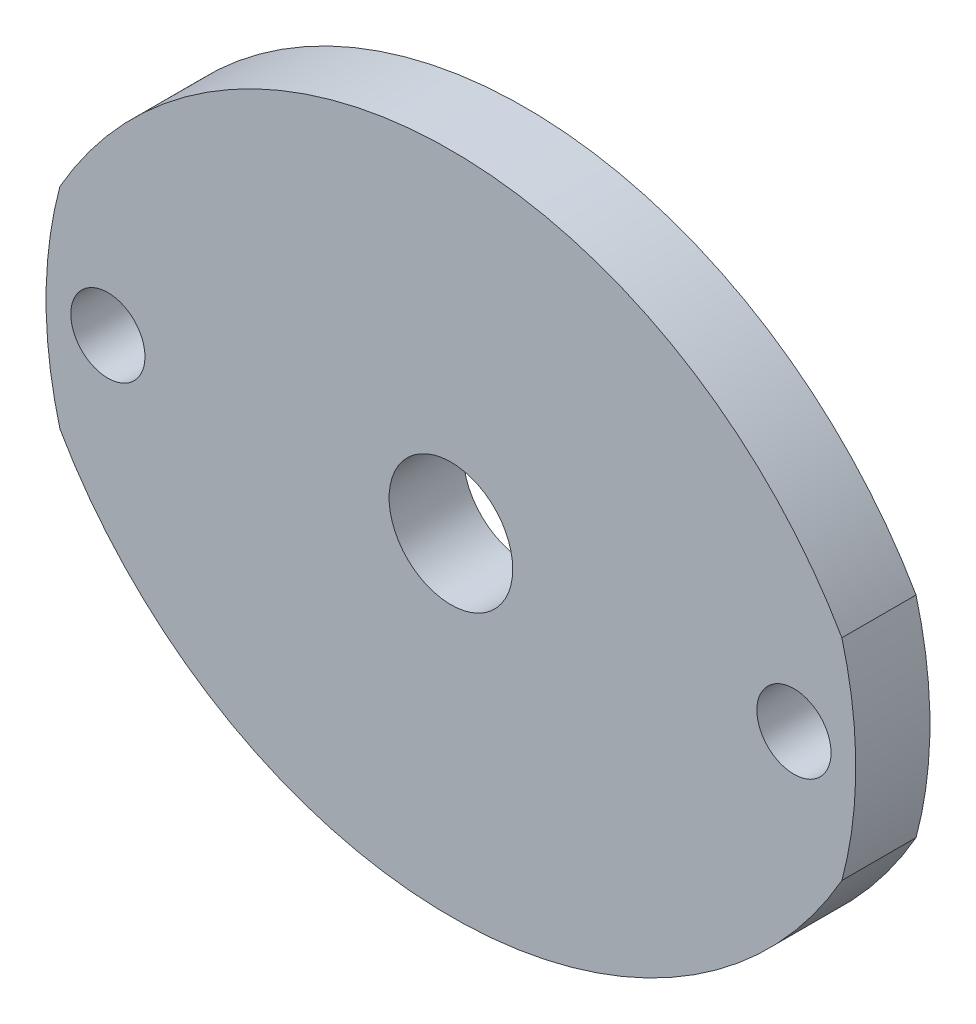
ISO-10303-21;
HEADER;
FILE_DESCRIPTION(('STEP AP214'),'2;1');
FILE_NAME('part.step','',(''),(''),'','','');
FILE_SCHEMA(('AUTOMOTIVE_DESIGN { 1 0 10303 214 1 1 1 1 }'));
ENDSEC;
DATA;
#1=APPLICATION_CONTEXT('core data for automotive mechanical design processes');
#2=APPLICATION_PROTOCOL_DEFINITION('international standard','automotive_design',2000,#1);
#3=PRODUCT_CONTEXT('',#1,'mechanical');
#4=PRODUCT('Part','Part','',(#3));
#5=PRODUCT_RELATED_PRODUCT_CATEGORY('part','',(#4));
#6=PRODUCT_DEFINITION_FORMATION('','',#4);
#7=PRODUCT_DEFINITION_CONTEXT('part definition',#1,'design');
#8=PRODUCT_DEFINITION('design','',#6,#7);
#9=PRODUCT_DEFINITION_SHAPE('','',#8);
#10=(LENGTH_UNIT() NAMED_UNIT(*) SI_UNIT(.MILLI.,.METRE.));
#11=(NAMED_UNIT(*) PLANE_ANGLE_UNIT() SI_UNIT($,.RADIAN.));
#12=(NAMED_UNIT(*) SI_UNIT($,.STERADIAN.) SOLID_ANGLE_UNIT());
#13=UNCERTAINTY_MEASURE_WITH_UNIT(LENGTH_MEASURE(1.E-05),#10,'distance_accuracy_value','');
#14=(GEOMETRIC_REPRESENTATION_CONTEXT(3) GLOBAL_UNCERTAINTY_ASSIGNED_CONTEXT((#13)) GLOBAL_UNIT_ASSIGNED_CONTEXT((#10,
#11,#12)) REPRESENTATION_CONTEXT('',''));
#15=CARTESIAN_POINT('',(0.,0.,0.));
#16=DIRECTION('',(0.,0.,1.));
#17=DIRECTION('',(1.,0.,0.));
#18=AXIS2_PLACEMENT_3D('',#15,#16,#17);
#19=CARTESIAN_POINT('',(18.2001874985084,-2.62133091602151,3.));
#20=DIRECTION('',(0.,0.,1.));
#21=DIRECTION('',(1.,0.,0.));
#22=AXIS2_PLACEMENT_3D('',#19,#20,#21);
#23=PLANE('',#22);
#24=CARTESIAN_POINT('',(32.0751874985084,-0.225930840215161,3.));
#25=DIRECTION('',(0.,0.,1.));
#26=DIRECTION('',(1.,0.,0.));
#27=AXIS2_PLACEMENT_3D('',#24,#25,#26);
#28=CIRCLE('',#27,1.5);
#29=CARTESIAN_POINT('',(33.5751874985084,-0.225930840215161,3.));
#30=VERTEX_POINT('',#29);
#31=EDGE_CURVE('E142',#30,#30,#28,.T.);
#32=ORIENTED_EDGE('',*,*,#31,.F.);
#33=EDGE_LOOP('',(#32));
#34=FACE_BOUND('',#33,.T.);
#35=CARTESIAN_POINT('',(18.2001874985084,-5.01673099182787,3.));
#36=DIRECTION('',(0.,0.,1.));
#37=DIRECTION('',(1.,0.,0.));
#38=AXIS2_PLACEMENT_3D('',#35,#36,#37);
#39=CIRCLE('',#38,18.2158001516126);
#40=CARTESIAN_POINT('',(34.0140129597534,4.02419260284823,3.));
#41=VERTEX_POINT('',#40);
#42=CARTESIAN_POINT('',(2.38636203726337,4.02419260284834,3.));
#43=VERTEX_POINT('',#42);
#44=EDGE_CURVE('E99',#41,#43,#39,.T.);
#45=ORIENTED_EDGE('',*,*,#44,.T.);
#46=CARTESIAN_POINT('',(18.2001874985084,-0.225930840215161,3.));
#47=DIRECTION('',(0.,0.,1.));
#48=DIRECTION('',(1.,0.,0.));
#49=AXIS2_PLACEMENT_3D('',#46,#47,#48);
#50=CIRCLE('',#49,16.375);
#51=CARTESIAN_POINT('',(2.38636203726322,-4.47605428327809,3.));
#52=VERTEX_POINT('',#51);
#53=EDGE_CURVE('E94',#43,#52,#50,.T.);
#54=ORIENTED_EDGE('',*,*,#53,.T.);
#55=CARTESIAN_POINT('',(18.2001874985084,4.56486931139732,3.));
#56=DIRECTION('',(0.,0.,1.));
#57=DIRECTION('',(1.,0.,0.));
#58=AXIS2_PLACEMENT_3D('',#55,#56,#57);
#59=CIRCLE('',#58,18.2158001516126);
#60=CARTESIAN_POINT('',(34.0140129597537,-4.47605428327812,3.));
#61=VERTEX_POINT('',#60);
#62=EDGE_CURVE('E97',#52,#61,#59,.T.);
#63=ORIENTED_EDGE('',*,*,#62,.T.);
#64=CARTESIAN_POINT('',(18.2001874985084,-0.225930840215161,3.));
#65=DIRECTION('',(0.,0.,1.));
#66=DIRECTION('',(1.,0.,0.));
#67=AXIS2_PLACEMENT_3D('',#64,#65,#66);
#68=CIRCLE('',#67,16.375);
#69=EDGE_CURVE('E59',#61,#41,#68,.T.);
#70=ORIENTED_EDGE('',*,*,#69,.T.);
#71=EDGE_LOOP('',(#45,#54,#63,#70));
#72=FACE_BOUND('',#71,.T.);
#73=CARTESIAN_POINT('',(18.2001874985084,-0.225930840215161,3.));
#74=DIRECTION('',(0.,0.,1.));
#75=DIRECTION('',(1.,0.,0.));
#76=AXIS2_PLACEMENT_3D('',#73,#74,#75);
#77=CIRCLE('',#76,2.5);
#78=CARTESIAN_POINT('',(20.7001874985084,-0.225930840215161,3.));
#79=VERTEX_POINT('',#78);
#80=EDGE_CURVE('E120',#79,#79,#77,.T.);
#81=ORIENTED_EDGE('',*,*,#80,.F.);
#82=EDGE_LOOP('',(#81));
#83=FACE_BOUND('',#82,.T.);
#84=CARTESIAN_POINT('',(4.32518749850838,-0.225930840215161,3.));
#85=DIRECTION('',(0.,0.,1.));
#86=DIRECTION('',(1.,0.,0.));
#87=AXIS2_PLACEMENT_3D('',#84,#85,#86);
#88=CIRCLE('',#87,1.5);
#89=CARTESIAN_POINT('',(5.82518749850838,-0.225930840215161,3.));
#90=VERTEX_POINT('',#89);
#91=EDGE_CURVE('E149',#90,#90,#88,.T.);
#92=ORIENTED_EDGE('',*,*,#91,.F.);
#93=EDGE_LOOP('',(#92));
#94=FACE_BOUND('',#93,.T.);
#95=ADVANCED_FACE('F38',(#34,#72,#83,#94),#23,.T.);
#96=CARTESIAN_POINT('',(18.2001874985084,-2.62133091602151,0.));
#97=DIRECTION('',(0.,0.,1.));
#98=DIRECTION('',(1.,0.,0.));
#99=AXIS2_PLACEMENT_3D('',#96,#97,#98);
#100=PLANE('',#99);
#101=CARTESIAN_POINT('',(18.2001874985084,-5.01673099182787,0.));
#102=DIRECTION('',(0.,0.,1.));
#103=DIRECTION('',(1.,0.,0.));
#104=AXIS2_PLACEMENT_3D('',#101,#102,#103);
#105=CIRCLE('',#104,18.2158001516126);
#106=CARTESIAN_POINT('',(34.0140129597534,4.02419260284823,0.));
#107=VERTEX_POINT('',#106);
#108=CARTESIAN_POINT('',(2.38636203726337,4.02419260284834,0.));
#109=VERTEX_POINT('',#108);
#110=EDGE_CURVE('E117',#107,#109,#105,.T.);
#111=ORIENTED_EDGE('',*,*,#110,.F.);
#112=CARTESIAN_POINT('',(18.2001874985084,-0.225930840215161,0.));
#113=DIRECTION('',(0.,0.,1.));
#114=DIRECTION('',(1.,0.,0.));
#115=AXIS2_PLACEMENT_3D('',#112,#113,#114);
#116=CIRCLE('',#115,16.375);
#117=CARTESIAN_POINT('',(34.0140129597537,-4.47605428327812,0.));
#118=VERTEX_POINT('',#117);
#119=EDGE_CURVE('E86',#118,#107,#116,.T.);
#120=ORIENTED_EDGE('',*,*,#119,.F.);
#121=CARTESIAN_POINT('',(18.2001874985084,4.56486931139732,0.));
#122=DIRECTION('',(0.,0.,1.));
#123=DIRECTION('',(1.,0.,0.));
#124=AXIS2_PLACEMENT_3D('',#121,#122,#123);
#125=CIRCLE('',#124,18.2158001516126);
#126=CARTESIAN_POINT('',(2.38636203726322,-4.47605428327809,0.));
#127=VERTEX_POINT('',#126);
#128=EDGE_CURVE('E80',#127,#118,#125,.T.);
#129=ORIENTED_EDGE('',*,*,#128,.F.);
#130=CARTESIAN_POINT('',(18.2001874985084,-0.225930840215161,0.));
#131=DIRECTION('',(0.,0.,1.));
#132=DIRECTION('',(1.,0.,0.));
#133=AXIS2_PLACEMENT_3D('',#130,#131,#132);
#134=CIRCLE('',#133,16.375);
#135=EDGE_CURVE('E104',#109,#127,#134,.T.);
#136=ORIENTED_EDGE('',*,*,#135,.F.);
#137=EDGE_LOOP('',(#111,#120,#129,#136));
#138=FACE_BOUND('',#137,.T.);
#139=CARTESIAN_POINT('',(18.2001874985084,-0.225930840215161,0.));
#140=DIRECTION('',(0.,0.,1.));
#141=DIRECTION('',(1.,0.,0.));
#142=AXIS2_PLACEMENT_3D('',#139,#140,#141);
#143=CIRCLE('',#142,2.5);
#144=CARTESIAN_POINT('',(20.7001874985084,-0.225930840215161,0.));
#145=VERTEX_POINT('',#144);
#146=EDGE_CURVE('E138',#145,#145,#143,.T.);
#147=ORIENTED_EDGE('',*,*,#146,.T.);
#148=EDGE_LOOP('',(#147));
#149=FACE_BOUND('',#148,.T.);
#150=CARTESIAN_POINT('',(32.0751874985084,-0.225930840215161,0.));
#151=DIRECTION('',(0.,0.,1.));
#152=DIRECTION('',(1.,0.,0.));
#153=AXIS2_PLACEMENT_3D('',#150,#151,#152);
#154=CIRCLE('',#153,1.5);
#155=CARTESIAN_POINT('',(33.5751874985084,-0.225930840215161,0.));
#156=VERTEX_POINT('',#155);
#157=EDGE_CURVE('E145',#156,#156,#154,.T.);
#158=ORIENTED_EDGE('',*,*,#157,.T.);
#159=EDGE_LOOP('',(#158));
#160=FACE_BOUND('',#159,.T.);
#161=CARTESIAN_POINT('',(4.32518749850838,-0.225930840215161,0.));
#162=DIRECTION('',(0.,0.,1.));
#163=DIRECTION('',(1.,0.,0.));
#164=AXIS2_PLACEMENT_3D('',#161,#162,#163);
#165=CIRCLE('',#164,1.5);
#166=CARTESIAN_POINT('',(5.82518749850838,-0.225930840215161,0.));
#167=VERTEX_POINT('',#166);
#168=EDGE_CURVE('E153',#167,#167,#165,.T.);
#169=ORIENTED_EDGE('',*,*,#168,.T.);
#170=EDGE_LOOP('',(#169));
#171=FACE_BOUND('',#170,.T.);
#172=ADVANCED_FACE('F133',(#138,#149,#160,#171),#100,.F.);
#173=CARTESIAN_POINT('',(18.2001874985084,-5.01673099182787,3.));
#174=DIRECTION('',(0.,0.,-1.));
#175=DIRECTION('',(-1.,0.,0.));
#176=AXIS2_PLACEMENT_3D('',#173,#174,#175);
#177=CYLINDRICAL_SURFACE('',#176,18.2158001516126);
#178=ORIENTED_EDGE('',*,*,#110,.T.);
#179=DIRECTION('',(0.,0.,-1.));
#180=VECTOR('',#179,1.);
#181=CARTESIAN_POINT('',(2.38636203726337,4.02419260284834,3.));
#182=LINE('',#181,#180);
#183=EDGE_CURVE('E11',#43,#109,#182,.T.);
#184=ORIENTED_EDGE('',*,*,#183,.F.);
#185=ORIENTED_EDGE('',*,*,#44,.F.);
#186=DIRECTION('',(0.,0.,-1.));
#187=VECTOR('',#186,1.);
#188=CARTESIAN_POINT('',(34.0140129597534,4.02419260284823,3.));
#189=LINE('',#188,#187);
#190=EDGE_CURVE('E113',#41,#107,#189,.T.);
#191=ORIENTED_EDGE('',*,*,#190,.T.);
#192=EDGE_LOOP('',(#178,#184,#185,#191));
#193=FACE_BOUND('',#192,.T.);
#194=ADVANCED_FACE('F40',(#193),#177,.T.);
#195=CARTESIAN_POINT('',(18.2001874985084,-0.225930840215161,3.));
#196=DIRECTION('',(0.,0.,-1.));
#197=DIRECTION('',(-1.,0.,0.));
#198=AXIS2_PLACEMENT_3D('',#195,#196,#197);
#199=CYLINDRICAL_SURFACE('',#198,16.375);
#200=ORIENTED_EDGE('',*,*,#135,.T.);
#201=DIRECTION('',(0.,0.,-1.));
#202=VECTOR('',#201,1.);
#203=CARTESIAN_POINT('',(2.38636203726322,-4.47605428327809,3.));
#204=LINE('',#203,#202);
#205=EDGE_CURVE('E48',#52,#127,#204,.T.);
#206=ORIENTED_EDGE('',*,*,#205,.F.);
#207=ORIENTED_EDGE('',*,*,#53,.F.);
#208=ORIENTED_EDGE('',*,*,#183,.T.);
#209=EDGE_LOOP('',(#200,#206,#207,#208));
#210=FACE_BOUND('',#209,.T.);
#211=ADVANCED_FACE('F103',(#210),#199,.T.);
#212=CARTESIAN_POINT('',(18.2001874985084,4.56486931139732,3.));
#213=DIRECTION('',(0.,0.,-1.));
#214=DIRECTION('',(-1.,0.,0.));
#215=AXIS2_PLACEMENT_3D('',#212,#213,#214);
#216=CYLINDRICAL_SURFACE('',#215,18.2158001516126);
#217=ORIENTED_EDGE('',*,*,#128,.T.);
#218=DIRECTION('',(0.,0.,-1.));
#219=VECTOR('',#218,1.);
#220=CARTESIAN_POINT('',(34.0140129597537,-4.47605428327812,3.));
#221=LINE('',#220,#219);
#222=EDGE_CURVE('E106',#61,#118,#221,.T.);
#223=ORIENTED_EDGE('',*,*,#222,.F.);
#224=ORIENTED_EDGE('',*,*,#62,.F.);
#225=ORIENTED_EDGE('',*,*,#205,.T.);
#226=EDGE_LOOP('',(#217,#223,#224,#225));
#227=FACE_BOUND('',#226,.T.);
#228=ADVANCED_FACE('F107',(#227),#216,.T.);
#229=CARTESIAN_POINT('',(18.2001874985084,-0.225930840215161,3.));
#230=DIRECTION('',(0.,0.,-1.));
#231=DIRECTION('',(-1.,0.,0.));
#232=AXIS2_PLACEMENT_3D('',#229,#230,#231);
#233=CYLINDRICAL_SURFACE('',#232,16.375);
#234=ORIENTED_EDGE('',*,*,#119,.T.);
#235=ORIENTED_EDGE('',*,*,#190,.F.);
#236=ORIENTED_EDGE('',*,*,#69,.F.);
#237=ORIENTED_EDGE('',*,*,#222,.T.);
#238=EDGE_LOOP('',(#234,#235,#236,#237));
#239=FACE_BOUND('',#238,.T.);
#240=ADVANCED_FACE('F130',(#239),#233,.T.);
#241=CARTESIAN_POINT('',(18.2001874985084,-0.225930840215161,3.));
#242=DIRECTION('',(0.,0.,-1.));
#243=DIRECTION('',(-1.,0.,0.));
#244=AXIS2_PLACEMENT_3D('',#241,#242,#243);
#245=CYLINDRICAL_SURFACE('',#244,2.5);
#246=ORIENTED_EDGE('',*,*,#80,.T.);
#247=EDGE_LOOP('',(#246));
#248=FACE_BOUND('',#247,.T.);
#249=ORIENTED_EDGE('',*,*,#146,.F.);
#250=EDGE_LOOP('',(#249));
#251=FACE_BOUND('',#250,.T.);
#252=ADVANCED_FACE('F173',(#248,#251),#245,.F.);
#253=CARTESIAN_POINT('',(32.0751874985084,-0.225930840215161,3.));
#254=DIRECTION('',(0.,0.,-1.));
#255=DIRECTION('',(-1.,0.,0.));
#256=AXIS2_PLACEMENT_3D('',#253,#254,#255);
#257=CYLINDRICAL_SURFACE('',#256,1.5);
#258=ORIENTED_EDGE('',*,*,#31,.T.);
#259=EDGE_LOOP('',(#258));
#260=FACE_BOUND('',#259,.T.);
#261=ORIENTED_EDGE('',*,*,#157,.F.);
#262=EDGE_LOOP('',(#261));
#263=FACE_BOUND('',#262,.T.);
#264=ADVANCED_FACE('F223',(#260,#263),#257,.F.);
#265=CARTESIAN_POINT('',(4.32518749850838,-0.225930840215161,3.));
#266=DIRECTION('',(0.,0.,-1.));
#267=DIRECTION('',(-1.,0.,0.));
#268=AXIS2_PLACEMENT_3D('',#265,#266,#267);
#269=CYLINDRICAL_SURFACE('',#268,1.5);
#270=ORIENTED_EDGE('',*,*,#91,.T.);
#271=EDGE_LOOP('',(#270));
#272=FACE_BOUND('',#271,.T.);
#273=ORIENTED_EDGE('',*,*,#168,.F.);
#274=EDGE_LOOP('',(#273));
#275=FACE_BOUND('',#274,.T.);
#276=ADVANCED_FACE('F161',(#272,#275),#269,.F.);
#277=CLOSED_SHELL('',(#95,#172,#194,#211,#228,#240,#252,#264,#276));
#278=MANIFOLD_SOLID_BREP('B2',#277);
#279=ADVANCED_BREP_SHAPE_REPRESENTATION('',(#18,#278),#14);
#280=SHAPE_DEFINITION_REPRESENTATION(#9,#279);
ENDSEC;
END-ISO-10303-21;
